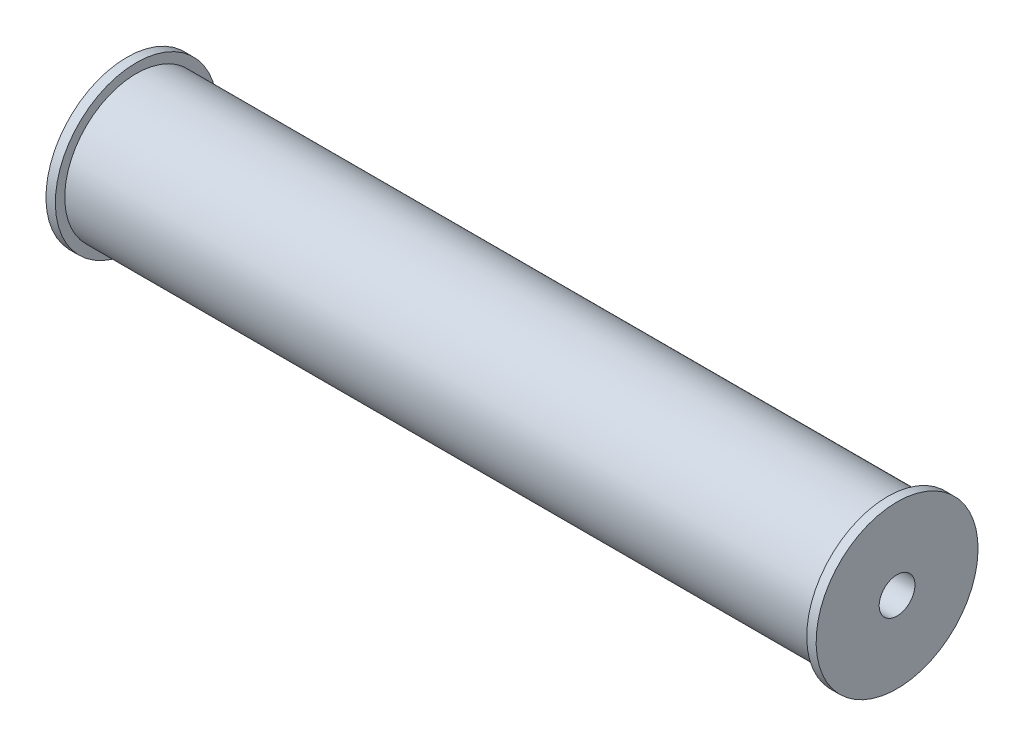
from build123d import *

# Parameters (mm, degrees)
SKETCH1_R           = 19.05
SKETCH1_R_2         = 4.7625
BOSS_EXTRUDE1_DEPTH = 205
SKETCH2_R           = 21.549999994
SKETCH2_R_2         = 19.049999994
BOSS_EXTRUDE2_DEPTH = 2.5


with BuildPart() as part:
    # Sketch1 → Boss-Extrude1 (new body)
    with BuildSketch(Plane(origin=(3359.611854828, -126.99910194, 62.970727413), x_dir=(0, 0, -1), z_dir=(-1, 0, 0))):
        with Locations((1.879280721, 46.492699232)):
            Circle(SKETCH1_R)
        with Locations((1.879280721, 46.492699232)):
            Circle(SKETCH1_R_2, mode=Mode.SUBTRACT)
    extrude(amount=BOSS_EXTRUDE1_DEPTH)

    # Sketch2 → Boss-Extrude2 (add)
    with BuildSketch(Plane(origin=(3359.611854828, 0, 0), x_dir=(0, 0, -1), z_dir=(1, 0, 0))):
        with Locations(Location((-61.091446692, -173.491801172, 0), (0, 0, 90))):
            Circle(SKETCH2_R)
        with Locations((-61.091446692, -173.491801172)):
            Circle(SKETCH2_R_2, mode=Mode.SUBTRACT)
    boss_extrude2 = extrude(amount=-BOSS_EXTRUDE2_DEPTH)

    # Mirror1: Boss-Extrude2 across plane
    add(boss_extrude2.mirror(Plane(origin=(3257.111854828, 0, 0), x_dir=(0, 0, 1), z_dir=(1, 0, 0))))


solid = part.part
